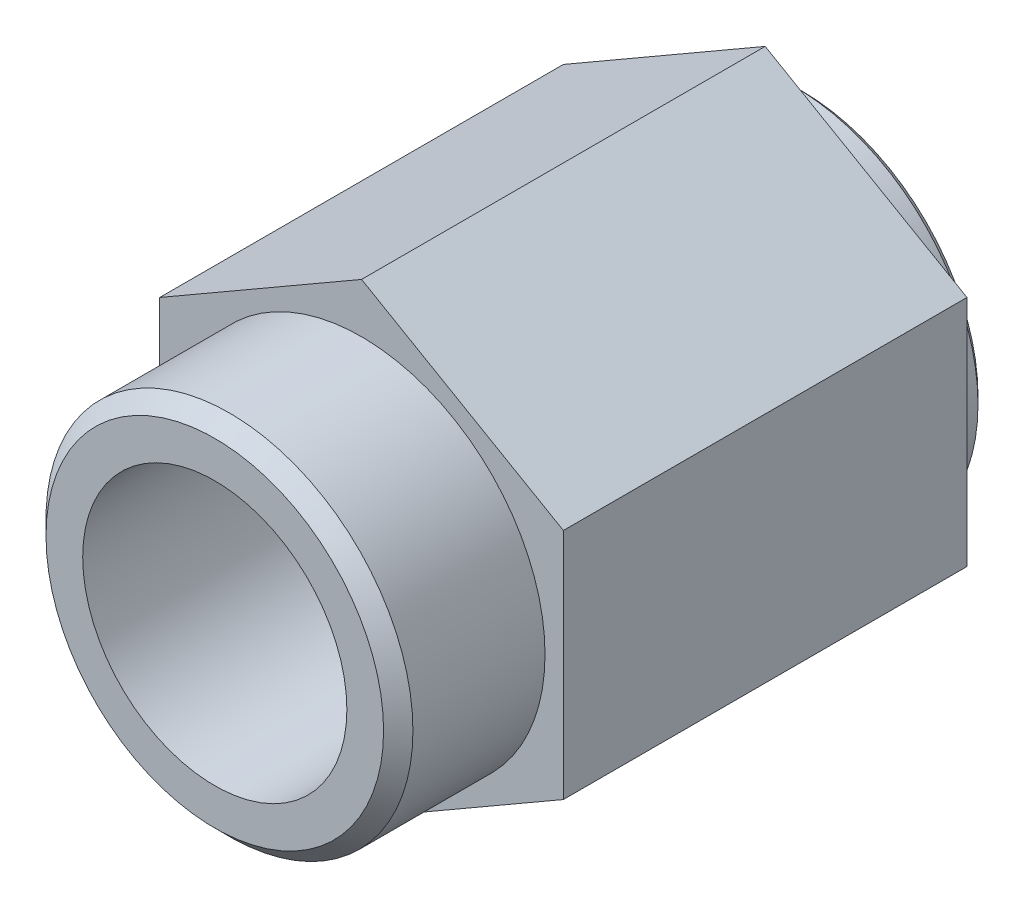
ISO-10303-21;
HEADER;
FILE_DESCRIPTION(('STEP AP214'),'2;1');
FILE_NAME('part.step','',(''),(''),'','','');
FILE_SCHEMA(('AUTOMOTIVE_DESIGN { 1 0 10303 214 1 1 1 1 }'));
ENDSEC;
DATA;
#1=APPLICATION_CONTEXT('core data for automotive mechanical design processes');
#2=APPLICATION_PROTOCOL_DEFINITION('international standard','automotive_design',2000,#1);
#3=PRODUCT_CONTEXT('',#1,'mechanical');
#4=PRODUCT('Part','Part','',(#3));
#5=PRODUCT_RELATED_PRODUCT_CATEGORY('part','',(#4));
#6=PRODUCT_DEFINITION_FORMATION('','',#4);
#7=PRODUCT_DEFINITION_CONTEXT('part definition',#1,'design');
#8=PRODUCT_DEFINITION('design','',#6,#7);
#9=PRODUCT_DEFINITION_SHAPE('','',#8);
#10=(LENGTH_UNIT() NAMED_UNIT(*) SI_UNIT(.MILLI.,.METRE.));
#11=(NAMED_UNIT(*) PLANE_ANGLE_UNIT() SI_UNIT($,.RADIAN.));
#12=(NAMED_UNIT(*) SI_UNIT($,.STERADIAN.) SOLID_ANGLE_UNIT());
#13=UNCERTAINTY_MEASURE_WITH_UNIT(LENGTH_MEASURE(1.E-05),#10,'distance_accuracy_value','');
#14=(GEOMETRIC_REPRESENTATION_CONTEXT(3) GLOBAL_UNCERTAINTY_ASSIGNED_CONTEXT((#13)) GLOBAL_UNIT_ASSIGNED_CONTEXT((#10,
#11,#12)) REPRESENTATION_CONTEXT('',''));
#15=CARTESIAN_POINT('',(0.,0.,0.));
#16=DIRECTION('',(0.,0.,1.));
#17=DIRECTION('',(1.,0.,0.));
#18=AXIS2_PLACEMENT_3D('',#15,#16,#17);
#19=CARTESIAN_POINT('',(27.5,15.8771324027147,55.));
#20=DIRECTION('',(-0.5,-0.866025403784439,0.));
#21=DIRECTION('',(0.866025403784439,-0.5,0.));
#22=AXIS2_PLACEMENT_3D('',#19,#20,#21);
#23=PLANE('',#22);
#24=DIRECTION('',(-0.866025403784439,0.5,0.));
#25=VECTOR('',#24,1.);
#26=CARTESIAN_POINT('',(27.5,15.8771324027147,0.));
#27=LINE('',#26,#25);
#28=CARTESIAN_POINT('',(27.5,15.8771324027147,0.));
#29=VERTEX_POINT('',#28);
#30=CARTESIAN_POINT('',(0.,31.7542648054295,0.));
#31=VERTEX_POINT('',#30);
#32=EDGE_CURVE('E123',#29,#31,#27,.T.);
#33=ORIENTED_EDGE('',*,*,#32,.T.);
#34=DIRECTION('',(0.,0.,-1.));
#35=VECTOR('',#34,1.);
#36=CARTESIAN_POINT('',(0.,31.7542648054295,55.));
#37=LINE('',#36,#35);
#38=CARTESIAN_POINT('',(0.,31.7542648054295,55.));
#39=VERTEX_POINT('',#38);
#40=EDGE_CURVE('E141',#39,#31,#37,.T.);
#41=ORIENTED_EDGE('',*,*,#40,.F.);
#42=DIRECTION('',(-0.866025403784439,0.5,0.));
#43=VECTOR('',#42,1.);
#44=CARTESIAN_POINT('',(27.5,15.8771324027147,55.));
#45=LINE('',#44,#43);
#46=CARTESIAN_POINT('',(27.5,15.8771324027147,55.));
#47=VERTEX_POINT('',#46);
#48=EDGE_CURVE('E134',#47,#39,#45,.T.);
#49=ORIENTED_EDGE('',*,*,#48,.F.);
#50=DIRECTION('',(0.,0.,-1.));
#51=VECTOR('',#50,1.);
#52=CARTESIAN_POINT('',(27.5,15.8771324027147,55.));
#53=LINE('',#52,#51);
#54=EDGE_CURVE('E119',#47,#29,#53,.T.);
#55=ORIENTED_EDGE('',*,*,#54,.T.);
#56=EDGE_LOOP('',(#33,#41,#49,#55));
#57=FACE_BOUND('',#56,.T.);
#58=ADVANCED_FACE('F37',(#57),#23,.F.);
#59=CARTESIAN_POINT('',(0.,31.7542648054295,55.));
#60=DIRECTION('',(0.5,-0.866025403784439,0.));
#61=DIRECTION('',(0.866025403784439,0.5,0.));
#62=AXIS2_PLACEMENT_3D('',#59,#60,#61);
#63=PLANE('',#62);
#64=DIRECTION('',(-0.866025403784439,-0.5,0.));
#65=VECTOR('',#64,1.);
#66=CARTESIAN_POINT('',(0.,31.7542648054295,0.));
#67=LINE('',#66,#65);
#68=CARTESIAN_POINT('',(-27.5,15.8771324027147,0.));
#69=VERTEX_POINT('',#68);
#70=EDGE_CURVE('E126',#31,#69,#67,.T.);
#71=ORIENTED_EDGE('',*,*,#70,.T.);
#72=DIRECTION('',(0.,0.,-1.));
#73=VECTOR('',#72,1.);
#74=CARTESIAN_POINT('',(-27.5,15.8771324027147,55.));
#75=LINE('',#74,#73);
#76=CARTESIAN_POINT('',(-27.5,15.8771324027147,55.));
#77=VERTEX_POINT('',#76);
#78=EDGE_CURVE('E138',#77,#69,#75,.T.);
#79=ORIENTED_EDGE('',*,*,#78,.F.);
#80=DIRECTION('',(-0.866025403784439,-0.5,0.));
#81=VECTOR('',#80,1.);
#82=CARTESIAN_POINT('',(0.,31.7542648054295,55.));
#83=LINE('',#82,#81);
#84=EDGE_CURVE('E92',#39,#77,#83,.T.);
#85=ORIENTED_EDGE('',*,*,#84,.F.);
#86=ORIENTED_EDGE('',*,*,#40,.T.);
#87=EDGE_LOOP('',(#71,#79,#85,#86));
#88=FACE_BOUND('',#87,.T.);
#89=ADVANCED_FACE('F167',(#88),#63,.F.);
#90=CARTESIAN_POINT('',(-27.5,15.8771324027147,55.));
#91=DIRECTION('',(1.,0.,0.));
#92=DIRECTION('',(0.,1.,0.));
#93=AXIS2_PLACEMENT_3D('',#90,#91,#92);
#94=PLANE('',#93);
#95=DIRECTION('',(0.,-1.,0.));
#96=VECTOR('',#95,1.);
#97=CARTESIAN_POINT('',(-27.5,15.8771324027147,0.));
#98=LINE('',#97,#96);
#99=CARTESIAN_POINT('',(-27.5,-15.8771324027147,0.));
#100=VERTEX_POINT('',#99);
#101=EDGE_CURVE('E129',#69,#100,#98,.T.);
#102=ORIENTED_EDGE('',*,*,#101,.T.);
#103=DIRECTION('',(0.,0.,-1.));
#104=VECTOR('',#103,1.);
#105=CARTESIAN_POINT('',(-27.5,-15.8771324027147,55.));
#106=LINE('',#105,#104);
#107=CARTESIAN_POINT('',(-27.5,-15.8771324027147,55.));
#108=VERTEX_POINT('',#107);
#109=EDGE_CURVE('E114',#108,#100,#106,.T.);
#110=ORIENTED_EDGE('',*,*,#109,.F.);
#111=DIRECTION('',(0.,-1.,0.));
#112=VECTOR('',#111,1.);
#113=CARTESIAN_POINT('',(-27.5,15.8771324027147,55.));
#114=LINE('',#113,#112);
#115=EDGE_CURVE('E105',#77,#108,#114,.T.);
#116=ORIENTED_EDGE('',*,*,#115,.F.);
#117=ORIENTED_EDGE('',*,*,#78,.T.);
#118=EDGE_LOOP('',(#102,#110,#116,#117));
#119=FACE_BOUND('',#118,.T.);
#120=ADVANCED_FACE('F173',(#119),#94,.F.);
#121=CARTESIAN_POINT('',(-27.5,-15.8771324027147,55.));
#122=DIRECTION('',(0.5,0.866025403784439,0.));
#123=DIRECTION('',(-0.866025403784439,0.5,0.));
#124=AXIS2_PLACEMENT_3D('',#121,#122,#123);
#125=PLANE('',#124);
#126=DIRECTION('',(0.866025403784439,-0.5,0.));
#127=VECTOR('',#126,1.);
#128=CARTESIAN_POINT('',(-27.5,-15.8771324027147,0.));
#129=LINE('',#128,#127);
#130=CARTESIAN_POINT('',(0.,-31.7542648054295,0.));
#131=VERTEX_POINT('',#130);
#132=EDGE_CURVE('E113',#100,#131,#129,.T.);
#133=ORIENTED_EDGE('',*,*,#132,.T.);
#134=DIRECTION('',(0.,0.,-1.));
#135=VECTOR('',#134,1.);
#136=CARTESIAN_POINT('',(0.,-31.7542648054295,55.));
#137=LINE('',#136,#135);
#138=CARTESIAN_POINT('',(0.,-31.7542648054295,55.));
#139=VERTEX_POINT('',#138);
#140=EDGE_CURVE('E110',#139,#131,#137,.T.);
#141=ORIENTED_EDGE('',*,*,#140,.F.);
#142=DIRECTION('',(0.866025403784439,-0.5,0.));
#143=VECTOR('',#142,1.);
#144=CARTESIAN_POINT('',(-27.5,-15.8771324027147,55.));
#145=LINE('',#144,#143);
#146=EDGE_CURVE('E99',#108,#139,#145,.T.);
#147=ORIENTED_EDGE('',*,*,#146,.F.);
#148=ORIENTED_EDGE('',*,*,#109,.T.);
#149=EDGE_LOOP('',(#133,#141,#147,#148));
#150=FACE_BOUND('',#149,.T.);
#151=ADVANCED_FACE('F111',(#150),#125,.F.);
#152=CARTESIAN_POINT('',(0.,-31.7542648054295,55.));
#153=DIRECTION('',(-0.5,0.866025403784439,0.));
#154=DIRECTION('',(-0.866025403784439,-0.5,0.));
#155=AXIS2_PLACEMENT_3D('',#152,#153,#154);
#156=PLANE('',#155);
#157=DIRECTION('',(0.866025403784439,0.5,0.));
#158=VECTOR('',#157,1.);
#159=CARTESIAN_POINT('',(0.,-31.7542648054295,0.));
#160=LINE('',#159,#158);
#161=CARTESIAN_POINT('',(27.5,-15.8771324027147,0.));
#162=VERTEX_POINT('',#161);
#163=EDGE_CURVE('E77',#131,#162,#160,.T.);
#164=ORIENTED_EDGE('',*,*,#163,.T.);
#165=DIRECTION('',(0.,0.,-1.));
#166=VECTOR('',#165,1.);
#167=CARTESIAN_POINT('',(27.5,-15.8771324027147,55.));
#168=LINE('',#167,#166);
#169=CARTESIAN_POINT('',(27.5,-15.8771324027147,55.));
#170=VERTEX_POINT('',#169);
#171=EDGE_CURVE('E115',#170,#162,#168,.T.);
#172=ORIENTED_EDGE('',*,*,#171,.F.);
#173=DIRECTION('',(0.866025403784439,0.5,0.));
#174=VECTOR('',#173,1.);
#175=CARTESIAN_POINT('',(0.,-31.7542648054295,55.));
#176=LINE('',#175,#174);
#177=EDGE_CURVE('E103',#139,#170,#176,.T.);
#178=ORIENTED_EDGE('',*,*,#177,.F.);
#179=ORIENTED_EDGE('',*,*,#140,.T.);
#180=EDGE_LOOP('',(#164,#172,#178,#179));
#181=FACE_BOUND('',#180,.T.);
#182=ADVANCED_FACE('F117',(#181),#156,.F.);
#183=CARTESIAN_POINT('',(27.5,-15.8771324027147,55.));
#184=DIRECTION('',(-1.,0.,0.));
#185=DIRECTION('',(0.,0.,1.));
#186=AXIS2_PLACEMENT_3D('',#183,#184,#185);
#187=PLANE('',#186);
#188=DIRECTION('',(0.,1.,0.));
#189=VECTOR('',#188,1.);
#190=CARTESIAN_POINT('',(27.5,-15.8771324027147,0.));
#191=LINE('',#190,#189);
#192=EDGE_CURVE('E83',#162,#29,#191,.T.);
#193=ORIENTED_EDGE('',*,*,#192,.T.);
#194=ORIENTED_EDGE('',*,*,#54,.F.);
#195=DIRECTION('',(0.,1.,0.));
#196=VECTOR('',#195,1.);
#197=CARTESIAN_POINT('',(27.5,-15.8771324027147,55.));
#198=LINE('',#197,#196);
#199=EDGE_CURVE('E54',#170,#47,#198,.T.);
#200=ORIENTED_EDGE('',*,*,#199,.F.);
#201=ORIENTED_EDGE('',*,*,#171,.T.);
#202=EDGE_LOOP('',(#193,#194,#200,#201));
#203=FACE_BOUND('',#202,.T.);
#204=ADVANCED_FACE('F183',(#203),#187,.F.);
#205=CARTESIAN_POINT('',(0.,0.,55.));
#206=DIRECTION('',(0.,0.,1.));
#207=DIRECTION('',(1.,0.,0.));
#208=AXIS2_PLACEMENT_3D('',#205,#206,#207);
#209=PLANE('',#208);
#210=CARTESIAN_POINT('',(0.,0.,55.));
#211=DIRECTION('',(0.,0.,1.));
#212=DIRECTION('',(1.,0.,0.));
#213=AXIS2_PLACEMENT_3D('',#210,#211,#212);
#214=CIRCLE('',#213,25.);
#215=CARTESIAN_POINT('',(25.,0.,55.));
#216=VERTEX_POINT('',#215);
#217=EDGE_CURVE('E127',#216,#216,#214,.T.);
#218=ORIENTED_EDGE('',*,*,#217,.F.);
#219=EDGE_LOOP('',(#218));
#220=FACE_BOUND('',#219,.T.);
#221=ORIENTED_EDGE('',*,*,#48,.T.);
#222=ORIENTED_EDGE('',*,*,#84,.T.);
#223=ORIENTED_EDGE('',*,*,#115,.T.);
#224=ORIENTED_EDGE('',*,*,#146,.T.);
#225=ORIENTED_EDGE('',*,*,#177,.T.);
#226=ORIENTED_EDGE('',*,*,#199,.T.);
#227=EDGE_LOOP('',(#221,#222,#223,#224,#225,#226));
#228=FACE_BOUND('',#227,.T.);
#229=ADVANCED_FACE('F101',(#220,#228),#209,.T.);
#230=CARTESIAN_POINT('',(0.,0.,0.));
#231=DIRECTION('',(0.,0.,1.));
#232=DIRECTION('',(1.,0.,0.));
#233=AXIS2_PLACEMENT_3D('',#230,#231,#232);
#234=PLANE('',#233);
#235=CARTESIAN_POINT('',(0.,0.,0.));
#236=DIRECTION('',(0.,0.,1.));
#237=DIRECTION('',(1.,0.,0.));
#238=AXIS2_PLACEMENT_3D('',#235,#236,#237);
#239=CIRCLE('',#238,25.);
#240=CARTESIAN_POINT('',(25.,0.,0.));
#241=VERTEX_POINT('',#240);
#242=EDGE_CURVE('E143',#241,#241,#239,.F.);
#243=ORIENTED_EDGE('',*,*,#242,.F.);
#244=EDGE_LOOP('',(#243));
#245=FACE_BOUND('',#244,.T.);
#246=ORIENTED_EDGE('',*,*,#32,.F.);
#247=ORIENTED_EDGE('',*,*,#192,.F.);
#248=ORIENTED_EDGE('',*,*,#163,.F.);
#249=ORIENTED_EDGE('',*,*,#132,.F.);
#250=ORIENTED_EDGE('',*,*,#101,.F.);
#251=ORIENTED_EDGE('',*,*,#70,.F.);
#252=EDGE_LOOP('',(#246,#247,#248,#249,#250,#251));
#253=FACE_BOUND('',#252,.T.);
#254=ADVANCED_FACE('F186',(#245,#253),#234,.F.);
#255=CARTESIAN_POINT('',(0.,0.,75.));
#256=DIRECTION('',(0.,0.,-1.));
#257=DIRECTION('',(-1.,0.,0.));
#258=AXIS2_PLACEMENT_3D('',#255,#256,#257);
#259=CYLINDRICAL_SURFACE('',#258,25.);
#260=CARTESIAN_POINT('',(0.,0.,73.));
#261=DIRECTION('',(0.,0.,1.));
#262=DIRECTION('',(1.,0.,0.));
#263=AXIS2_PLACEMENT_3D('',#260,#261,#262);
#264=CIRCLE('',#263,25.);
#265=CARTESIAN_POINT('',(25.,0.,73.));
#266=VERTEX_POINT('',#265);
#267=EDGE_CURVE('E149',#266,#266,#264,.F.);
#268=ORIENTED_EDGE('',*,*,#267,.T.);
#269=EDGE_LOOP('',(#268));
#270=FACE_BOUND('',#269,.T.);
#271=ORIENTED_EDGE('',*,*,#217,.T.);
#272=EDGE_LOOP('',(#271));
#273=FACE_BOUND('',#272,.T.);
#274=ADVANCED_FACE('F189',(#270,#273),#259,.T.);
#275=CARTESIAN_POINT('',(0.,0.,75.));
#276=DIRECTION('',(0.,0.,1.));
#277=DIRECTION('',(1.,0.,0.));
#278=AXIS2_PLACEMENT_3D('',#275,#276,#277);
#279=PLANE('',#278);
#280=CARTESIAN_POINT('',(0.,0.,75.));
#281=DIRECTION('',(0.,0.,1.));
#282=DIRECTION('',(1.,0.,0.));
#283=AXIS2_PLACEMENT_3D('',#280,#281,#282);
#284=CIRCLE('',#283,23.);
#285=CARTESIAN_POINT('',(23.,0.,75.));
#286=VERTEX_POINT('',#285);
#287=EDGE_CURVE('E146',#286,#286,#284,.T.);
#288=ORIENTED_EDGE('',*,*,#287,.T.);
#289=EDGE_LOOP('',(#288));
#290=FACE_BOUND('',#289,.T.);
#291=CARTESIAN_POINT('',(0.,0.,75.));
#292=DIRECTION('',(0.,0.,1.));
#293=DIRECTION('',(1.,0.,0.));
#294=AXIS2_PLACEMENT_3D('',#291,#292,#293);
#295=CIRCLE('',#294,18.);
#296=CARTESIAN_POINT('',(18.,0.,75.));
#297=VERTEX_POINT('',#296);
#298=EDGE_CURVE('E230',#297,#297,#295,.T.);
#299=ORIENTED_EDGE('',*,*,#298,.F.);
#300=EDGE_LOOP('',(#299));
#301=FACE_BOUND('',#300,.T.);
#302=ADVANCED_FACE('F196',(#290,#301),#279,.T.);
#303=CARTESIAN_POINT('',(0.,0.,-5.));
#304=DIRECTION('',(0.,0.,1.));
#305=DIRECTION('',(1.,0.,0.));
#306=AXIS2_PLACEMENT_3D('',#303,#304,#305);
#307=CYLINDRICAL_SURFACE('',#306,25.);
#308=CARTESIAN_POINT('',(0.,0.,-4.00000000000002));
#309=DIRECTION('',(0.,0.,-1.));
#310=DIRECTION('',(-1.,0.,0.));
#311=AXIS2_PLACEMENT_3D('',#308,#309,#310);
#312=CIRCLE('',#311,25.);
#313=CARTESIAN_POINT('',(-25.,0.,-4.00000000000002));
#314=VERTEX_POINT('',#313);
#315=EDGE_CURVE('E11',#314,#314,#312,.F.);
#316=ORIENTED_EDGE('',*,*,#315,.T.);
#317=EDGE_LOOP('',(#316));
#318=FACE_BOUND('',#317,.T.);
#319=ORIENTED_EDGE('',*,*,#242,.T.);
#320=EDGE_LOOP('',(#319));
#321=FACE_BOUND('',#320,.T.);
#322=ADVANCED_FACE('F200',(#318,#321),#307,.T.);
#323=CARTESIAN_POINT('',(0.,0.,-5.));
#324=DIRECTION('',(0.,0.,-1.));
#325=DIRECTION('',(-1.,0.,0.));
#326=AXIS2_PLACEMENT_3D('',#323,#324,#325);
#327=PLANE('',#326);
#328=CARTESIAN_POINT('',(0.,0.,-5.));
#329=DIRECTION('',(0.,0.,-1.));
#330=DIRECTION('',(-1.,0.,0.));
#331=AXIS2_PLACEMENT_3D('',#328,#329,#330);
#332=CIRCLE('',#331,24.);
#333=CARTESIAN_POINT('',(-24.,0.,-5.));
#334=VERTEX_POINT('',#333);
#335=EDGE_CURVE('E46',#334,#334,#332,.T.);
#336=ORIENTED_EDGE('',*,*,#335,.T.);
#337=EDGE_LOOP('',(#336));
#338=FACE_BOUND('',#337,.T.);
#339=CARTESIAN_POINT('',(0.,0.,-5.));
#340=DIRECTION('',(0.,0.,-1.));
#341=DIRECTION('',(-1.,0.,0.));
#342=AXIS2_PLACEMENT_3D('',#339,#340,#341);
#343=CIRCLE('',#342,10.);
#344=CARTESIAN_POINT('',(-10.,0.,-5.));
#345=VERTEX_POINT('',#344);
#346=EDGE_CURVE('E226',#345,#345,#343,.T.);
#347=ORIENTED_EDGE('',*,*,#346,.F.);
#348=EDGE_LOOP('',(#347));
#349=FACE_BOUND('',#348,.T.);
#350=ADVANCED_FACE('F154',(#338,#349),#327,.T.);
#351=CARTESIAN_POINT('',(0.,0.,35.));
#352=DIRECTION('',(0.,0.,-1.));
#353=DIRECTION('',(-1.,0.,0.));
#354=AXIS2_PLACEMENT_3D('',#351,#352,#353);
#355=CYLINDRICAL_SURFACE('',#354,10.);
#356=CARTESIAN_POINT('',(0.,0.,35.));
#357=DIRECTION('',(0.,0.,1.));
#358=DIRECTION('',(1.,0.,0.));
#359=AXIS2_PLACEMENT_3D('',#356,#357,#358);
#360=CIRCLE('',#359,10.);
#361=CARTESIAN_POINT('',(10.,0.,35.));
#362=VERTEX_POINT('',#361);
#363=EDGE_CURVE('E225',#362,#362,#360,.F.);
#364=ORIENTED_EDGE('',*,*,#363,.F.);
#365=EDGE_LOOP('',(#364));
#366=FACE_BOUND('',#365,.T.);
#367=ORIENTED_EDGE('',*,*,#346,.T.);
#368=EDGE_LOOP('',(#367));
#369=FACE_BOUND('',#368,.T.);
#370=ADVANCED_FACE('F207',(#366,#369),#355,.F.);
#371=CARTESIAN_POINT('',(0.,0.,35.));
#372=DIRECTION('',(0.,0.,1.));
#373=DIRECTION('',(1.,0.,0.));
#374=AXIS2_PLACEMENT_3D('',#371,#372,#373);
#375=PLANE('',#374);
#376=CARTESIAN_POINT('',(0.,0.,35.));
#377=DIRECTION('',(0.,0.,1.));
#378=DIRECTION('',(1.,0.,0.));
#379=AXIS2_PLACEMENT_3D('',#376,#377,#378);
#380=CIRCLE('',#379,18.);
#381=CARTESIAN_POINT('',(18.,0.,35.));
#382=VERTEX_POINT('',#381);
#383=EDGE_CURVE('E222',#382,#382,#380,.T.);
#384=ORIENTED_EDGE('',*,*,#383,.T.);
#385=EDGE_LOOP('',(#384));
#386=FACE_BOUND('',#385,.T.);
#387=ORIENTED_EDGE('',*,*,#363,.T.);
#388=EDGE_LOOP('',(#387));
#389=FACE_BOUND('',#388,.T.);
#390=ADVANCED_FACE('F210',(#386,#389),#375,.T.);
#391=CARTESIAN_POINT('',(0.,0.,35.));
#392=DIRECTION('',(0.,0.,1.));
#393=DIRECTION('',(1.,0.,0.));
#394=AXIS2_PLACEMENT_3D('',#391,#392,#393);
#395=CYLINDRICAL_SURFACE('',#394,18.);
#396=ORIENTED_EDGE('',*,*,#383,.F.);
#397=EDGE_LOOP('',(#396));
#398=FACE_BOUND('',#397,.T.);
#399=ORIENTED_EDGE('',*,*,#298,.T.);
#400=EDGE_LOOP('',(#399));
#401=FACE_BOUND('',#400,.T.);
#402=ADVANCED_FACE('F163',(#398,#401),#395,.F.);
#403=CARTESIAN_POINT('',(0.,0.,75.));
#404=DIRECTION('',(0.,0.,-1.));
#405=DIRECTION('',(-1.,0.,0.));
#406=AXIS2_PLACEMENT_3D('',#403,#404,#405);
#407=CONICAL_SURFACE('',#406,23.,0.785398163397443);
#408=ORIENTED_EDGE('',*,*,#267,.F.);
#409=EDGE_LOOP('',(#408));
#410=FACE_BOUND('',#409,.T.);
#411=ORIENTED_EDGE('',*,*,#287,.F.);
#412=EDGE_LOOP('',(#411));
#413=FACE_BOUND('',#412,.T.);
#414=ADVANCED_FACE('F158',(#410,#413),#407,.T.);
#415=CARTESIAN_POINT('',(0.,0.,-5.));
#416=DIRECTION('',(0.,0.,1.));
#417=DIRECTION('',(1.,0.,0.));
#418=AXIS2_PLACEMENT_3D('',#415,#416,#417);
#419=CONICAL_SURFACE('',#418,24.,0.785398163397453);
#420=ORIENTED_EDGE('',*,*,#315,.F.);
#421=EDGE_LOOP('',(#420));
#422=FACE_BOUND('',#421,.T.);
#423=ORIENTED_EDGE('',*,*,#335,.F.);
#424=EDGE_LOOP('',(#423));
#425=FACE_BOUND('',#424,.T.);
#426=ADVANCED_FACE('F39',(#422,#425),#419,.T.);
#427=CLOSED_SHELL('',(#58,#89,#120,#151,#182,#204,#229,#254,#274,#302,#322,#350,#370,#390,#402,
#414,#426));
#428=MANIFOLD_SOLID_BREP('B2',#427);
#429=ADVANCED_BREP_SHAPE_REPRESENTATION('',(#18,#428),#14);
#430=SHAPE_DEFINITION_REPRESENTATION(#9,#429);
ENDSEC;
END-ISO-10303-21;
